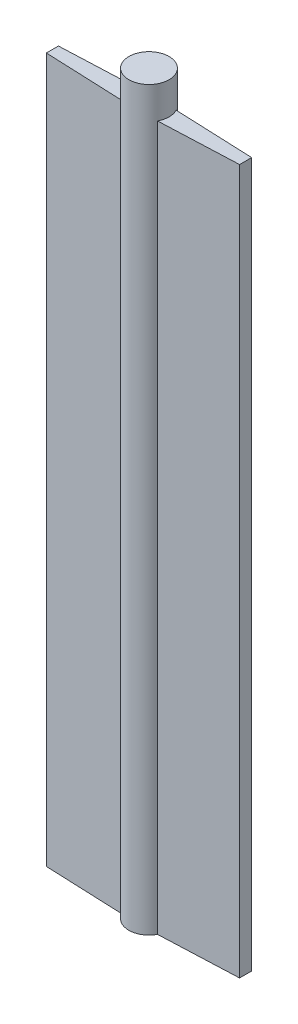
from build123d import *

# Parameters (mm, degrees)
SKETCH1_R           = 6.35
BOSS_EXTRUDE1_DEPTH = 222.25
SKETCH2_R           = 6.35
BOSS_EXTRUDE2_DEPTH = 10.16


with BuildPart() as part:
    # Sketch1 → Boss-Extrude1 (new body)
    with BuildSketch(Plane(origin=(0, 0, 0), x_dir=(1, 0, 0), z_dir=(0, 1, 0))):
        Circle(SKETCH1_R)
        Polygon((0, 3.175), (30.48, 1.905), (30.48, -1.905), (0, -3.175), (-30.48, -1.905), (-30.48, 1.905), align=None)
    extrude(amount=BOSS_EXTRUDE1_DEPTH)

    # Sketch2 → Boss-Extrude2 (add)
    with BuildSketch(Plane(origin=(0, 222.25, 0), x_dir=(1, 0, 0), z_dir=(0, 1, 0))):
        with Locations(Location((0, 0, 0), (0, 0, 27.5853824))):
            Circle(SKETCH2_R)
    extrude(amount=BOSS_EXTRUDE2_DEPTH)


solid = part.part
